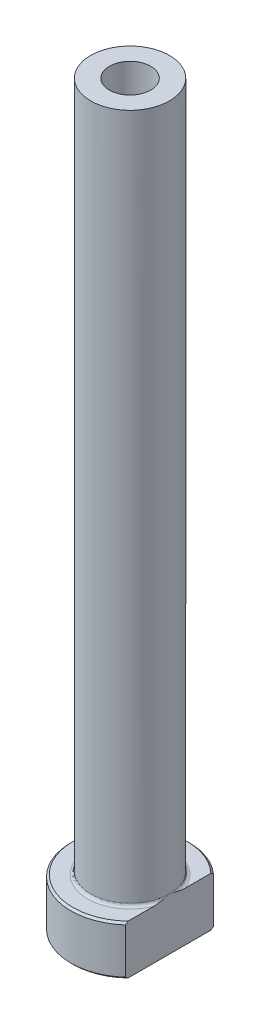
from build123d import *

# Parameters (mm, degrees)
FILLET1_R          = 0.3
CHAMFER1_SIZE      = 0.2
CUT_EXTRUDE1_DEPTH = 76.478473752
CHAMFER2_SIZE      = 0.5


with BuildPart() as part:
    # Sketch1 → Revolve1 (revolve)
    with BuildSketch(Plane.XY, mode=Mode.PRIVATE) as revolve1_sk:
        Polygon((-2.1, 75), (-4, 75), (-4, 5), (-6, 5), (-6, 0), (-2.35, 0), (-2.35, 18), (-2.1, 30), align=None)
    revolve(revolve1_sk.sketch.rotate(Axis((0, 92.187680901, 0), (0, -1, 0)), 270), axis=Axis((0, 92.187680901, 0), (0, -1, 0)))

    # Fillet1
    fillet1_edges = [part.edges().sort_by_distance(p)[0] for p in [
        (0, 5, -4),
    ]]
    fillet(fillet1_edges, radius=FILLET1_R)

    # Chamfer1
    chamfer1_edges = [part.edges().sort_by_distance(p)[0] for p in [
        (0, 0, -6),
        (0, 5, -6),
    ]]
    chamfer(chamfer1_edges, length=CHAMFER1_SIZE)

    # Sketch2 → Cut-Extrude1 (cut, through all)
    with BuildSketch(Plane.XZ):
        with BuildLine():
            Line((4, 4.472135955), (4, -4.472135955))
            ThreePointArc((4, -4.472135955), (6, 0), (4, 4.472135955))
        make_face()
    extrude(amount=-CUT_EXTRUDE1_DEPTH, mode=Mode.SUBTRACT)

    # Chamfer2
    chamfer2_edges = [part.edges().sort_by_distance(p)[0] for p in [
        (0, 0, -2.35),
    ]]
    chamfer(chamfer2_edges, length=CHAMFER2_SIZE)


solid = part.part
